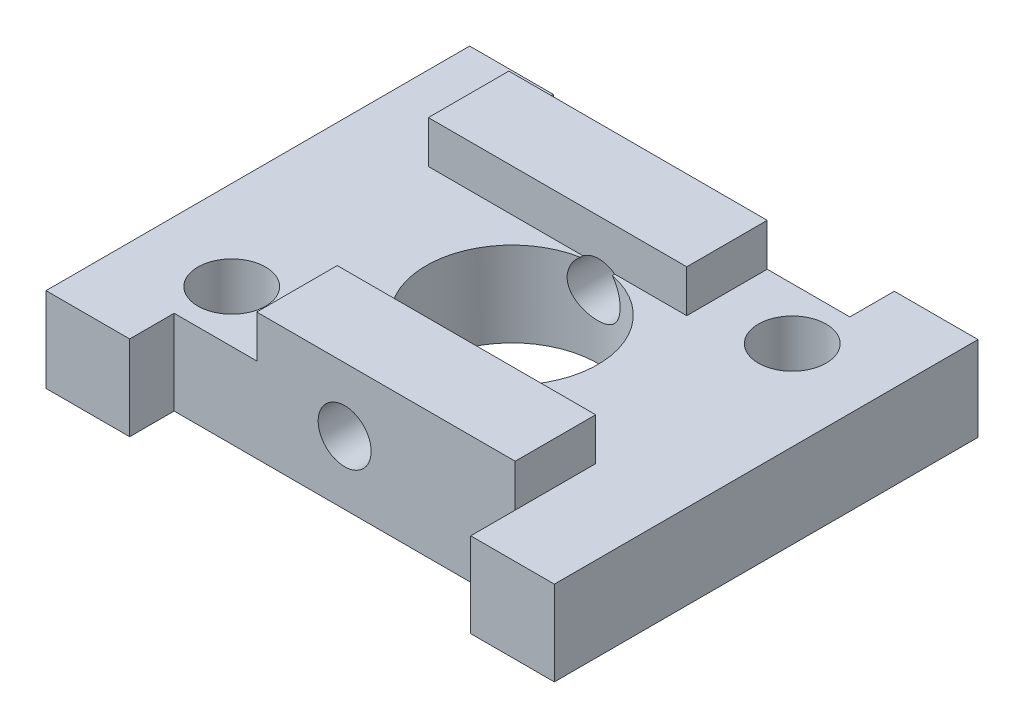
from build123d import *

# Parameters (mm, degrees)
SKETCH1_W                = 12
SKETCH1_H                = 10
SKETCH1_R                = 2.025
BOSS_EXTRUDE1_DEPTH      = 2
SKETCH2_R                = 0.8
SKETCH2_W                = 8.05
SKETCH2_H                = 1.05
CUT_EXTRUDE1_DEPTH       = 2
SKETCH3_W                = 6.1
SKETCH3_H                = 1.9
BOSS_EXTRUDE2_DEPTH      = 1
M1_6_TAPPED_HOLE1_REACH  = 13.185
M1_6_TAPPED_HOLE1_BORE_R = 0.625
M1_6_TAPPED_HOLE2_D      = 1.25


with BuildPart() as part:
    # Sketch1 → Boss-Extrude1 (new body)
    with BuildSketch(Plane(origin=(0, 0, 0), x_dir=(1, 0, 0), z_dir=(0, 1, 0))):
        Rectangle(SKETCH1_W, SKETCH1_H)
        with Locations(Location((0, 0, 0), (0, 0, 270))):
            Circle(SKETCH1_R, mode=Mode.SUBTRACT)
    extrude(amount=BOSS_EXTRUDE1_DEPTH)

    # Sketch2 → Cut-Extrude1 (cut)
    with BuildSketch(Plane(origin=(0, 2, 0), x_dir=(1, 0, 0), z_dir=(0, 1, 0))):
        with Locations(Location((3.89097221, 2.724488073, 0), (0, 0, 270))):
            Circle(SKETCH2_R)
        with Locations(Location((-3.89097221, -2.724488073, 0), (0, 0, 270))):
            Circle(SKETCH2_R)
        with Locations((0, 4.475)):
            Rectangle(SKETCH2_W, SKETCH2_H)
        with Locations((0, -4.475)):
            Rectangle(SKETCH2_W, SKETCH2_H)
    extrude(amount=-CUT_EXTRUDE1_DEPTH, mode=Mode.SUBTRACT)

    # Sketch3 → Boss-Extrude2 (add)
    with BuildSketch(Plane(origin=(0, 2, 0), x_dir=(1, 0, 0), z_dir=(0, 1, 0))):
        with Locations((-0.975, 3)):
            Rectangle(SKETCH3_W, SKETCH3_H)
        with Locations((0.975, -3)):
            Rectangle(SKETCH3_W, SKETCH3_H)
    extrude(amount=BOSS_EXTRUDE2_DEPTH)

    # M1.6 Tapped Hole1 bore → M1.6 Tapped Hole1 (cut, up to next)
    with BuildSketch(Plane.XY.offset(3.95), mode=Mode.PRIVATE) as m1_6_tapped_hole1_sk1:
        with Locations((0, 1.5)):
            Circle(M1_6_TAPPED_HOLE1_BORE_R)
    m1_6_tapped_hole1_tool1 = extrude(m1_6_tapped_hole1_sk1.sketch, amount=-M1_6_TAPPED_HOLE1_REACH, mode=Mode.PRIVATE) & part.part
    add(m1_6_tapped_hole1_tool1.solids().sort_by_distance((0, 1.5, 3.95))[0], mode=Mode.SUBTRACT)

    # M1.6 Tapped Hole2 (through all)
    with Locations(Plane(origin=(0, 0, -3.95), x_dir=(-1, 0, 0), z_dir=(0, 0, -1))):
        with Locations((0, 1.5)):
            Hole(M1_6_TAPPED_HOLE2_D / 2)


solid = part.part
